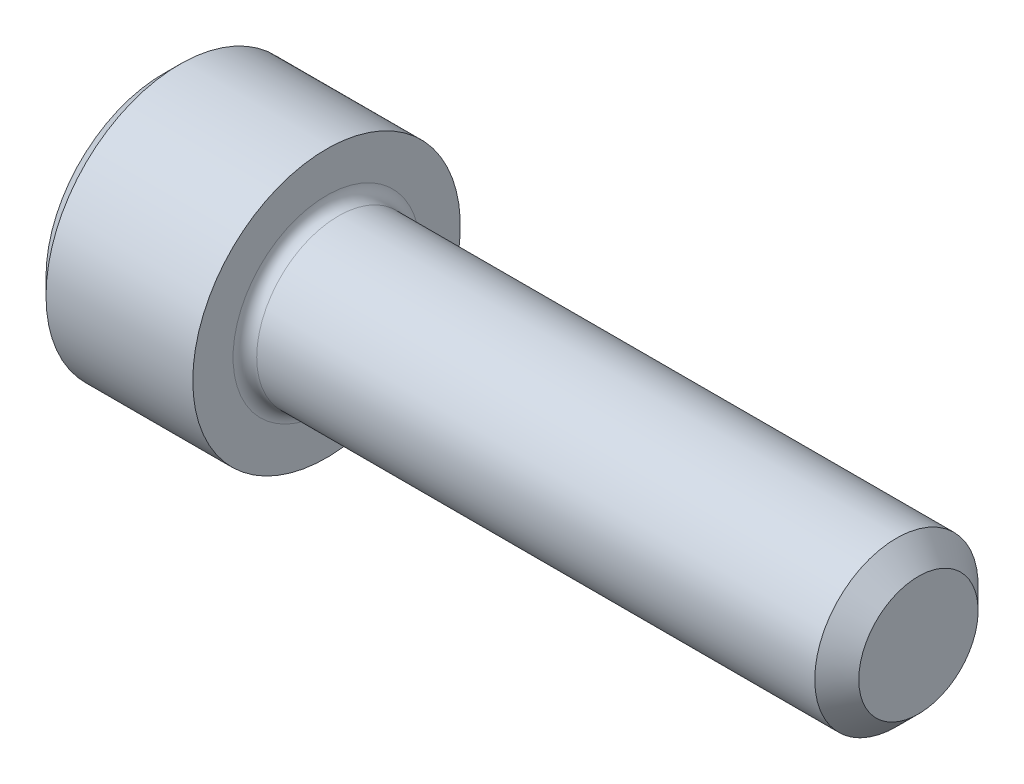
from build123d import *

# Parameters (mm, degrees)
FILLET1_R   = 0.254
HEX_2_DEPTH = 1.6256


with BuildPart() as part:
    # BodySke → Base-Revolve (revolve)
    with BuildSketch(Plane.XY, mode=Mode.PRIVATE) as base_revolve_sk:
        Polygon((0, 0), (0, 2.5146), (0.3556, 2.8702), (3.5052, 2.8702), (3.5052, 1.7526), (15.73276, 1.7526), (16.2052, 1.28016), (16.2052, 0), align=None)
    revolve(base_revolve_sk.sketch.rotate(Axis((-31.75, 0, 0), (1, 0, 0)), 90), axis=Axis((-31.75, 0, 0), (1, 0, 0)))

    # Fillet1
    fillet1_edges = [part.edges().sort_by_distance(p)[0] for p in [
        (3.5052, 0, -1.7526),
    ]]
    fillet(fillet1_edges, radius=FILLET1_R)

    # Sketch2 → Hex-PreBroach (revolve, cut)
    with BuildSketch(Plane.XY, mode=Mode.PRIVATE) as hex_prebroach_sk:
        Polygon((0, 1.3843), (1.6256, 1.3843), (2.424825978, 0), (0, 0), align=None)
    revolve(hex_prebroach_sk.sketch.rotate(Axis((0, 0, 0), (1, 0, 0)), 90), axis=Axis((0, 0, 0), (1, 0, 0)), mode=Mode.SUBTRACT)

    # Sketch3 → Hex 2 (cut)
    with BuildSketch(Plane(origin=(0, 0, 0), x_dir=(0, 0.500000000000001, 0.866025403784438), z_dir=(-1, 0, 0))):
        Polygon((0.799225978, 1.3843), (-0.799225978, 1.3843), (-1.598451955, 0), (-0.799225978, -1.3843), (0.799225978, -1.3843), (1.598451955, 0), align=None)
    extrude(amount=-HEX_2_DEPTH, mode=Mode.SUBTRACT)


solid = part.part
